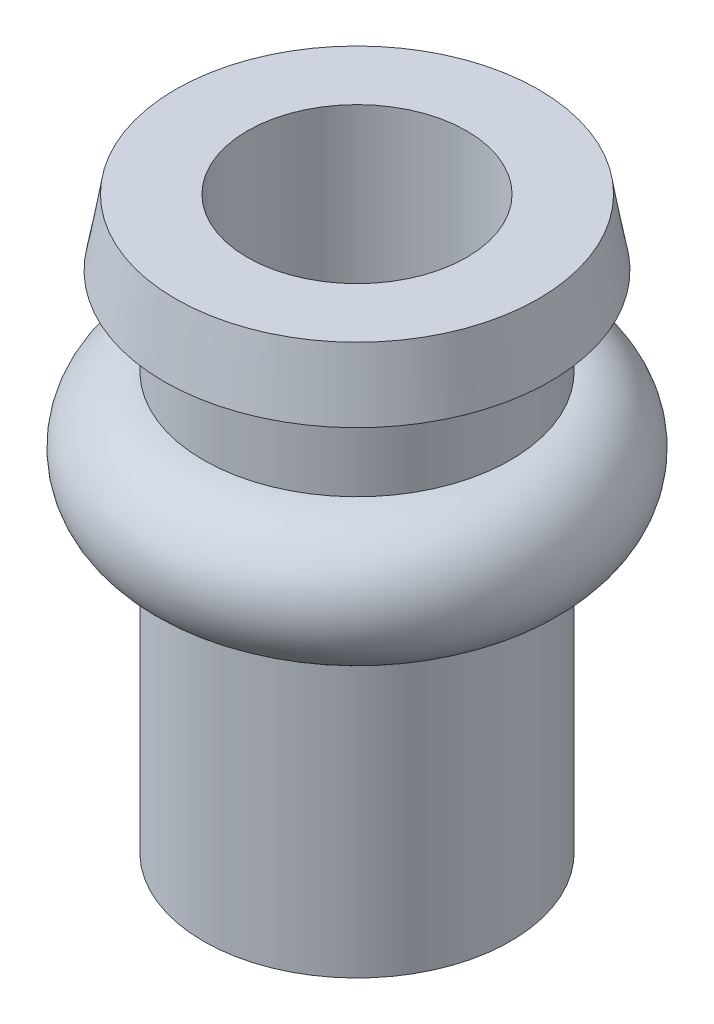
ISO-10303-21;
HEADER;
FILE_DESCRIPTION(('STEP AP214'),'2;1');
FILE_NAME('part.step','',(''),(''),'','','');
FILE_SCHEMA(('AUTOMOTIVE_DESIGN { 1 0 10303 214 1 1 1 1 }'));
ENDSEC;
DATA;
#1=APPLICATION_CONTEXT('core data for automotive mechanical design processes');
#2=APPLICATION_PROTOCOL_DEFINITION('international standard','automotive_design',2000,#1);
#3=PRODUCT_CONTEXT('',#1,'mechanical');
#4=PRODUCT('Part','Part','',(#3));
#5=PRODUCT_RELATED_PRODUCT_CATEGORY('part','',(#4));
#6=PRODUCT_DEFINITION_FORMATION('','',#4);
#7=PRODUCT_DEFINITION_CONTEXT('part definition',#1,'design');
#8=PRODUCT_DEFINITION('design','',#6,#7);
#9=PRODUCT_DEFINITION_SHAPE('','',#8);
#10=(LENGTH_UNIT() NAMED_UNIT(*) SI_UNIT(.MILLI.,.METRE.));
#11=(NAMED_UNIT(*) PLANE_ANGLE_UNIT() SI_UNIT($,.RADIAN.));
#12=(NAMED_UNIT(*) SI_UNIT($,.STERADIAN.) SOLID_ANGLE_UNIT());
#13=UNCERTAINTY_MEASURE_WITH_UNIT(LENGTH_MEASURE(1.E-05),#10,'distance_accuracy_value','');
#14=(GEOMETRIC_REPRESENTATION_CONTEXT(3) GLOBAL_UNCERTAINTY_ASSIGNED_CONTEXT((#13)) GLOBAL_UNIT_ASSIGNED_CONTEXT((#10,
#11,#12)) REPRESENTATION_CONTEXT('',''));
#15=CARTESIAN_POINT('',(0.,0.,0.));
#16=DIRECTION('',(0.,0.,1.));
#17=DIRECTION('',(1.,0.,0.));
#18=AXIS2_PLACEMENT_3D('',#15,#16,#17);
#19=CARTESIAN_POINT('',(4.13550952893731,13.,0.));
#20=DIRECTION('',(0.,-1.,0.));
#21=DIRECTION('',(0.,0.,-1.));
#22=AXIS2_PLACEMENT_3D('',#19,#20,#21);
#23=PLANE('',#22);
#24=CARTESIAN_POINT('',(0.,13.,0.));
#25=DIRECTION('',(0.,-1.,0.));
#26=DIRECTION('',(0.,0.,-1.));
#27=AXIS2_PLACEMENT_3D('',#24,#25,#26);
#28=CIRCLE('',#27,2.5);
#29=CARTESIAN_POINT('',(0.,13.,-2.5));
#30=VERTEX_POINT('',#29);
#31=EDGE_CURVE('E54',#30,#30,#28,.T.);
#32=ORIENTED_EDGE('',*,*,#31,.T.);
#33=EDGE_LOOP('',(#32));
#34=FACE_BOUND('',#33,.T.);
#35=CARTESIAN_POINT('',(0.,13.,0.));
#36=DIRECTION('',(0.,1.,0.));
#37=DIRECTION('',(0.,0.,1.));
#38=AXIS2_PLACEMENT_3D('',#35,#36,#37);
#39=CIRCLE('',#38,4.13550952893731);
#40=CARTESIAN_POINT('',(0.,13.,4.13550952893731));
#41=VERTEX_POINT('',#40);
#42=EDGE_CURVE('E10',#41,#41,#39,.T.);
#43=ORIENTED_EDGE('',*,*,#42,.T.);
#44=EDGE_LOOP('',(#43));
#45=FACE_BOUND('',#44,.T.);
#46=ADVANCED_FACE('F29',(#34,#45),#23,.F.);
#47=CARTESIAN_POINT('',(0.,11.5,0.));
#48=DIRECTION('',(0.,-1.,0.));
#49=DIRECTION('',(0.,0.,-1.));
#50=AXIS2_PLACEMENT_3D('',#47,#48,#49);
#51=CONICAL_SURFACE('',#50,4.4,0.174532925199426);
#52=ORIENTED_EDGE('',*,*,#42,.F.);
#53=EDGE_LOOP('',(#52));
#54=FACE_BOUND('',#53,.T.);
#55=CARTESIAN_POINT('',(0.,11.5,0.));
#56=DIRECTION('',(0.,1.,0.));
#57=DIRECTION('',(0.,0.,1.));
#58=AXIS2_PLACEMENT_3D('',#55,#56,#57);
#59=CIRCLE('',#58,4.4);
#60=CARTESIAN_POINT('',(0.,11.5,4.4));
#61=VERTEX_POINT('',#60);
#62=EDGE_CURVE('E35',#61,#61,#59,.T.);
#63=ORIENTED_EDGE('',*,*,#62,.T.);
#64=EDGE_LOOP('',(#63));
#65=FACE_BOUND('',#64,.T.);
#66=ADVANCED_FACE('F82',(#54,#65),#51,.T.);
#67=CARTESIAN_POINT('',(3.5,11.5,0.));
#68=DIRECTION('',(0.,1.,0.));
#69=DIRECTION('',(0.,0.,1.));
#70=AXIS2_PLACEMENT_3D('',#67,#68,#69);
#71=PLANE('',#70);
#72=ORIENTED_EDGE('',*,*,#62,.F.);
#73=EDGE_LOOP('',(#72));
#74=FACE_BOUND('',#73,.T.);
#75=CARTESIAN_POINT('',(0.,11.5,0.));
#76=DIRECTION('',(0.,1.,0.));
#77=DIRECTION('',(0.,0.,1.));
#78=AXIS2_PLACEMENT_3D('',#75,#76,#77);
#79=CIRCLE('',#78,3.5);
#80=CARTESIAN_POINT('',(0.,11.5,3.5));
#81=VERTEX_POINT('',#80);
#82=EDGE_CURVE('E39',#81,#81,#79,.T.);
#83=ORIENTED_EDGE('',*,*,#82,.T.);
#84=EDGE_LOOP('',(#83));
#85=FACE_BOUND('',#84,.T.);
#86=ADVANCED_FACE('F87',(#74,#85),#71,.F.);
#87=CARTESIAN_POINT('',(0.,38.9534603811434,0.));
#88=DIRECTION('',(0.,1.,0.));
#89=DIRECTION('',(0.,0.,1.));
#90=AXIS2_PLACEMENT_3D('',#87,#88,#89);
#91=CYLINDRICAL_SURFACE('',#90,3.5);
#92=ORIENTED_EDGE('',*,*,#82,.F.);
#93=EDGE_LOOP('',(#92));
#94=FACE_BOUND('',#93,.T.);
#95=CARTESIAN_POINT('',(0.,9.5,0.));
#96=DIRECTION('',(0.,1.,0.));
#97=DIRECTION('',(0.,0.,1.));
#98=AXIS2_PLACEMENT_3D('',#95,#96,#97);
#99=CIRCLE('',#98,3.5);
#100=CARTESIAN_POINT('',(0.,9.5,3.5));
#101=VERTEX_POINT('',#100);
#102=EDGE_CURVE('E43',#101,#101,#99,.T.);
#103=ORIENTED_EDGE('',*,*,#102,.T.);
#104=EDGE_LOOP('',(#103));
#105=FACE_BOUND('',#104,.T.);
#106=ADVANCED_FACE('F77',(#94,#105),#91,.T.);
#107=CARTESIAN_POINT('',(0.,8.,0.));
#108=DIRECTION('',(0.,1.,0.));
#109=DIRECTION('',(0.,0.,1.));
#110=AXIS2_PLACEMENT_3D('',#107,#108,#109);
#111=TOROIDAL_SURFACE('',#110,3.5,1.5);
#112=ORIENTED_EDGE('',*,*,#102,.F.);
#113=EDGE_LOOP('',(#112));
#114=FACE_BOUND('',#113,.T.);
#115=CARTESIAN_POINT('',(0.,6.5,0.));
#116=DIRECTION('',(0.,1.,0.));
#117=DIRECTION('',(0.,0.,1.));
#118=AXIS2_PLACEMENT_3D('',#115,#116,#117);
#119=CIRCLE('',#118,3.5);
#120=CARTESIAN_POINT('',(0.,6.5,3.5));
#121=VERTEX_POINT('',#120);
#122=EDGE_CURVE('E48',#121,#121,#119,.T.);
#123=ORIENTED_EDGE('',*,*,#122,.T.);
#124=EDGE_LOOP('',(#123));
#125=FACE_BOUND('',#124,.T.);
#126=ADVANCED_FACE('F71',(#114,#125),#111,.T.);
#127=CARTESIAN_POINT('',(0.,38.9534603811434,0.));
#128=DIRECTION('',(0.,1.,0.));
#129=DIRECTION('',(0.,0.,1.));
#130=AXIS2_PLACEMENT_3D('',#127,#128,#129);
#131=CYLINDRICAL_SURFACE('',#130,3.5);
#132=ORIENTED_EDGE('',*,*,#122,.F.);
#133=EDGE_LOOP('',(#132));
#134=FACE_BOUND('',#133,.T.);
#135=CARTESIAN_POINT('',(0.,0.,0.));
#136=DIRECTION('',(0.,1.,0.));
#137=DIRECTION('',(0.,0.,1.));
#138=AXIS2_PLACEMENT_3D('',#135,#136,#137);
#139=CIRCLE('',#138,3.5);
#140=CARTESIAN_POINT('',(0.,0.,3.5));
#141=VERTEX_POINT('',#140);
#142=EDGE_CURVE('E51',#141,#141,#139,.T.);
#143=ORIENTED_EDGE('',*,*,#142,.T.);
#144=EDGE_LOOP('',(#143));
#145=FACE_BOUND('',#144,.T.);
#146=ADVANCED_FACE('F66',(#134,#145),#131,.T.);
#147=CARTESIAN_POINT('',(3.5,0.,0.));
#148=DIRECTION('',(0.,1.,0.));
#149=DIRECTION('',(0.,0.,1.));
#150=AXIS2_PLACEMENT_3D('',#147,#148,#149);
#151=PLANE('',#150);
#152=CARTESIAN_POINT('',(0.,0.,0.));
#153=DIRECTION('',(0.,-1.,0.));
#154=DIRECTION('',(0.,0.,-1.));
#155=AXIS2_PLACEMENT_3D('',#152,#153,#154);
#156=CIRCLE('',#155,2.5);
#157=CARTESIAN_POINT('',(0.,0.,-2.5));
#158=VERTEX_POINT('',#157);
#159=EDGE_CURVE('E57',#158,#158,#156,.T.);
#160=ORIENTED_EDGE('',*,*,#159,.F.);
#161=EDGE_LOOP('',(#160));
#162=FACE_BOUND('',#161,.T.);
#163=ORIENTED_EDGE('',*,*,#142,.F.);
#164=EDGE_LOOP('',(#163));
#165=FACE_BOUND('',#164,.T.);
#166=ADVANCED_FACE('F63',(#162,#165),#151,.F.);
#167=CARTESIAN_POINT('',(0.,13.,0.));
#168=DIRECTION('',(0.,-1.,0.));
#169=DIRECTION('',(0.,0.,-1.));
#170=AXIS2_PLACEMENT_3D('',#167,#168,#169);
#171=CYLINDRICAL_SURFACE('',#170,2.5);
#172=ORIENTED_EDGE('',*,*,#31,.F.);
#173=EDGE_LOOP('',(#172));
#174=FACE_BOUND('',#173,.T.);
#175=ORIENTED_EDGE('',*,*,#159,.T.);
#176=EDGE_LOOP('',(#175));
#177=FACE_BOUND('',#176,.T.);
#178=ADVANCED_FACE('F61',(#174,#177),#171,.F.);
#179=CLOSED_SHELL('',(#46,#66,#86,#106,#126,#146,#166,#178));
#180=MANIFOLD_SOLID_BREP('B2',#179);
#181=ADVANCED_BREP_SHAPE_REPRESENTATION('',(#18,#180),#14);
#182=SHAPE_DEFINITION_REPRESENTATION(#9,#181);
ENDSEC;
END-ISO-10303-21;
